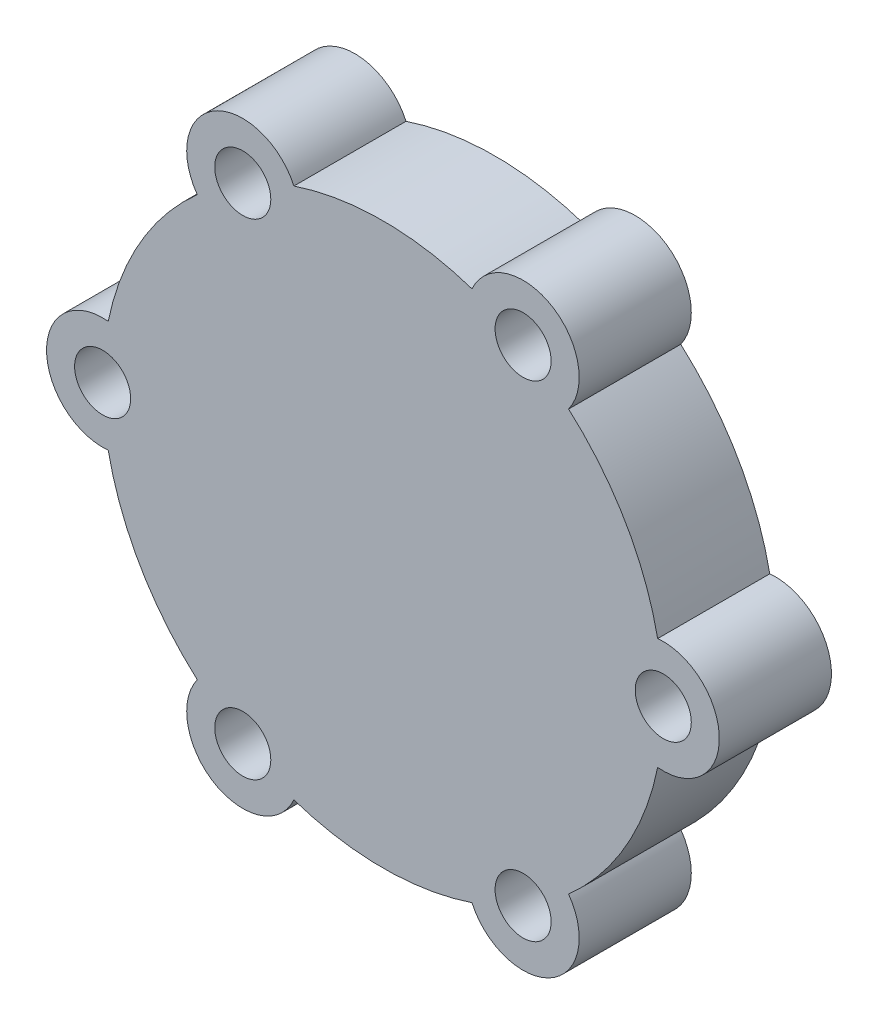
from build123d import *

# Parameters (mm, degrees)
SKETCH1_R           = 5
BOSS_EXTRUDE1_DEPTH = 20


with BuildPart() as part:
    # Sketch1 → Boss-Extrude1 (new body)
    with BuildSketch(Plane.XY):
        with BuildLine():
            ThreePointArc((119, 79.949874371), (113.301270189, 95), (103.11684397, 107.4603076))
            ThreePointArc((103.11684397, 107.4603076), (100, 121.961524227), (85.88315603, 117.410181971))
            ThreePointArc((85.88315603, 117.410181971), (70, 120), (54.11684397, 117.410181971))
            ThreePointArc((54.11684397, 117.410181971), (40, 121.961524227), (36.88315603, 107.4603076))
            ThreePointArc((36.88315603, 107.4603076), (26.698729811, 95), (21, 79.949874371))
            ThreePointArc((21, 79.949874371), (10, 70), (21, 60.050125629))
            ThreePointArc((21, 60.050125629), (26.698729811, 45), (36.88315603, 32.5396924))
            ThreePointArc((36.88315603, 32.5396924), (40, 18.038475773), (54.11684397, 22.589818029))
            ThreePointArc((54.11684397, 22.589818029), (70, 20), (85.88315603, 22.589818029))
            ThreePointArc((85.88315603, 22.589818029), (100, 18.038475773), (103.11684397, 32.5396924))
            ThreePointArc((103.11684397, 32.5396924), (113.301270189, 45), (119, 60.050125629))
            ThreePointArc((119, 60.050125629), (130, 70), (119, 79.949874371))
        make_face()
        with Locations((20, 70)):
            Circle(SKETCH1_R, mode=Mode.SUBTRACT)
        with Locations((45, 113.301270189)):
            Circle(SKETCH1_R, mode=Mode.SUBTRACT)
        with Locations((95, 113.301270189)):
            Circle(SKETCH1_R, mode=Mode.SUBTRACT)
        with Locations((120, 70)):
            Circle(SKETCH1_R, mode=Mode.SUBTRACT)
        with Locations((95, 26.698729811)):
            Circle(SKETCH1_R, mode=Mode.SUBTRACT)
        with Locations((45, 26.698729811)):
            Circle(SKETCH1_R, mode=Mode.SUBTRACT)
    extrude(amount=BOSS_EXTRUDE1_DEPTH)


solid = part.part
